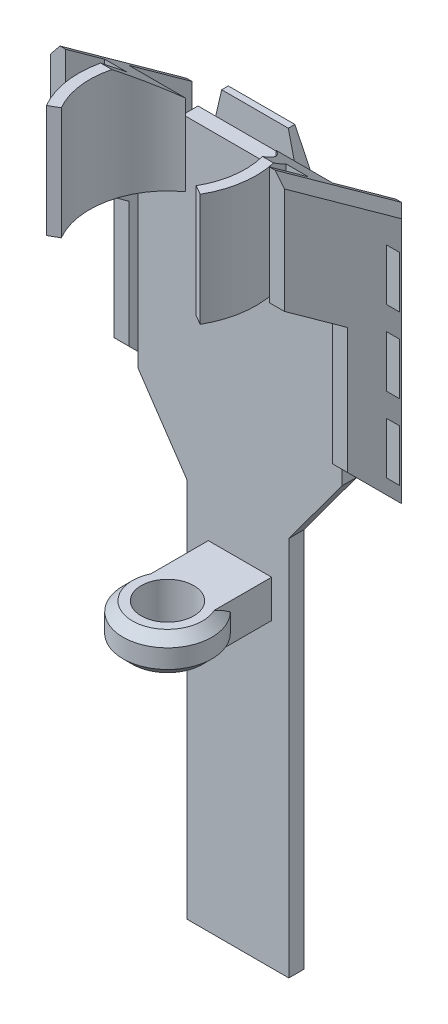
from build123d import *

# Parameters (mm, degrees)
SKETCH1_R           = 7
BOSS_EXTRUDE1_DEPTH = 10
CHAMFER1_SIZE       = 2.5
BOSS_EXTRUDE2_DEPTH = 4
CUT_EXTRUDE1_DEPTH  = 14
SKETCH4_W           = 54.262151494
SKETCH4_H           = 14.499051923
CUT_EXTRUDE2_DEPTH  = 14
BOSS_EXTRUDE3_DEPTH = 4
BOSS_EXTRUDE4_DEPTH = 4
CUT_EXTRUDE3_DEPTH  = 4
CUT_EXTRUDE4_DEPTH  = 83
LPATTERN2_COUNT     = 3
LPATTERN2_PITCH     = 20
BOSS_EXTRUDE6_DEPTH = 30
CUT_EXTRUDE7_DEPTH  = 73
BOSS_EXTRUDE7_DEPTH = 7
CUT_EXTRUDE8_DEPTH  = 33
CHAMFER2_SIZE       = 2.5


with BuildPart() as part:
    # Sketch1 → Boss-Extrude1 (new body)
    with BuildSketch(Plane(origin=(0, 0, 0), x_dir=(1, 0, 0), z_dir=(0, 1, 0))):
        with BuildLine():
            Line((-8.429952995, 8.305243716), (-8.429952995, 19.305243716))
            Line((-8.429952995, 19.305243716), (8.429952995, 19.305243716))
            Line((8.429952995, 19.305243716), (8.429952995, 8.305243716))
            ThreePointArc((8.429952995, 8.305243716), (0, -11.83389964), (-8.429952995, 8.305243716))
        make_face()
        with Locations(Location((0, 0, 0), (0, 0, 270))):
            Circle(SKETCH1_R, mode=Mode.SUBTRACT)
    extrude(amount=BOSS_EXTRUDE1_DEPTH)

    # Chamfer1
    chamfer1_edges = [part.edges().sort_by_distance(p)[0] for p in [
        (0, 10, 11.83389964),
        (0, 0, 11.83389964),
    ]]
    chamfer(chamfer1_edges, length=CHAMFER1_SIZE)

    # Sketch2 → Boss-Extrude2 (add)
    with BuildSketch(Plane(origin=(0, 0, -19.305243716), x_dir=(-1, 0, 0), z_dir=(0, 0, -1))):
        Polygon((14.130768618, -15.15472548), (27.131075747, -15.15472548), (27.131075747, 119.370191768), (-27.131075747, 119.370191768), (-27.131075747, -15.15472548), (-13.000307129, -15.15472548), (-13.000307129, -80.156261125), (14.130768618, -80.156261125), align=None)
    extrude(amount=BOSS_EXTRUDE2_DEPTH)

    # Sketch3 → Cut-Extrude1 (cut)
    with BuildSketch(Plane(origin=(0, 0, -23.305243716), x_dir=(-1, 0, 0), z_dir=(0, 0, -1))):
        Polygon((14.130768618, -15.15472548), (14.130768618, 21.210837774), (27.131075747, 40.398881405), (27.131075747, -15.15472548), align=None)
        Polygon((-13.000307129, -15.15472548), (-13.000307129, 21.210837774), (-27.131075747, 40.398881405), (-27.131075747, -15.15472548), align=None)
    extrude(amount=-CUT_EXTRUDE1_DEPTH, mode=Mode.SUBTRACT)

    # Sketch4 → Cut-Extrude2 (cut)
    with BuildSketch(Plane(origin=(0, 0, -23.305243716), x_dir=(-1, 0, 0), z_dir=(0, 0, -1))):
        with Locations((0, 112.120665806)):
            Rectangle(SKETCH4_W, SKETCH4_H)
    extrude(amount=-CUT_EXTRUDE2_DEPTH, mode=Mode.SUBTRACT)

    # Sketch5 → Boss-Extrude3 (add)
    with BuildSketch(Plane(origin=(27.131075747, 0, 0), x_dir=(0, 0, -1), z_dir=(1, 0, 0))):
        Polygon((33.720455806, 99.33039943), (0, 123.624184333), (0, 92.297988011), (16.860227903, 80.151095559), (16.860227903, 60.652136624), (16.860227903, 46.692944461), (33.720455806, 29.832716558), (33.720455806, 48.505244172), align=None)
    extrude(amount=BOSS_EXTRUDE3_DEPTH)

    # Sketch6 → Boss-Extrude4 (add)
    with BuildSketch(Plane.ZY.offset(27.131075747)):
        Polygon((-16.860227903, 46.692944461), (-33.720455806, 29.832716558), (-33.720455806, 99.33039943), (0, 123.624184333), (0, 92.297988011), (-16.860227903, 80.151095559), align=None)
    extrude(amount=BOSS_EXTRUDE4_DEPTH)

    # Sketch7 → Cut-Extrude3 (cut)
    with BuildSketch(Plane(origin=(0, 0, -23.305243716), x_dir=(-1, 0, 0), z_dir=(0, 0, -1))):
        Polygon((-16.226881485, 104.871139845), (-27.131075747, 90.65912158), (-27.131075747, 104.871139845), align=None)
        Polygon((15.175813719, 104.871139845), (27.131075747, 90.65912158), (27.131075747, 104.871139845), align=None)
    extrude(amount=-CUT_EXTRUDE3_DEPTH, mode=Mode.SUBTRACT)

    # Sketch8 → Cut-Extrude4 (cut)
    with BuildSketch(Plane.ZY.offset(31.131075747)):
        Polygon((-30.673708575, 36.815954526), (-27.237225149, 40.252437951), (-27.237225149, 53.998371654), (-30.673708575, 50.561888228), align=None)
    cut_extrude4 = extrude(amount=-CUT_EXTRUDE4_DEPTH, mode=Mode.SUBTRACT)

    # LPattern2: Cut-Extrude4 ×3
    with Locations(*[(0, i * LPATTERN2_PITCH, 0) for i in range(1, LPATTERN2_COUNT)]):
        add(cut_extrude4, mode=Mode.SUBTRACT)

    # Sketch11 → Boss-Extrude6 (add)
    with BuildSketch(Plane(origin=(0, 89.871139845, 0), x_dir=(1, 0, 0), z_dir=(0, 1, 0))):
        with BuildLine():
            Line((-27.131075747, 16.860227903), (-12.04620483, 16.860227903))
            ThreePointArc((-12.04620483, 16.860227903), (-20.246732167, 4.410008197), (-17.967060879, -10.322938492))
            Line((-17.967060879, -10.322938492), (-20.483736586, -11.76888943))
            ThreePointArc((-20.483736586, -11.76888943), (-23.610951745, -0.783058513), (-21.218499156, 10.385832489))
            Line((-21.218499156, 10.385832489), (-27.131075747, 10.385832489))
            Line((-27.131075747, 10.385832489), (-27.131075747, 16.860227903))
        make_face()
        with BuildLine():
            Line((27.131075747, 10.385832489), (27.131075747, 16.860227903))
            Line((27.131075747, 16.860227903), (12.04620483, 16.860227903))
            ThreePointArc((12.04620483, 16.860227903), (20.246732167, 4.410008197), (17.967060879, -10.322938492))
            Line((17.967060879, -10.322938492), (20.483736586, -11.76888943))
            ThreePointArc((20.483736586, -11.76888943), (23.610951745, -0.783058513), (21.218499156, 10.385832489))
            Line((21.218499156, 10.385832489), (27.131075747, 10.385832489))
        make_face()
    extrude(amount=BOSS_EXTRUDE6_DEPTH)

    # Sketch12 → Cut-Extrude7 (cut)
    with BuildSketch(Plane(origin=(31.131075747, 0, 0), x_dir=(0, 0, -1), z_dir=(1, 0, 0))):
        Polygon((5.236363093, 119.851664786), (16.860227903, 111.477291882), (16.860227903, 119.871139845), align=None)
        Polygon((16.860227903, 123.808396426), (16.860227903, 119.871139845), (5.236363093, 119.851664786), (5.236363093, 123.808396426), align=None)
    extrude(amount=-CUT_EXTRUDE7_DEPTH, mode=Mode.SUBTRACT)

    # Sketch13 → Boss-Extrude7 (add)
    with BuildSketch(Plane(origin=(0, 0, -23.305243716), x_dir=(-1, 0, 0), z_dir=(0, 0, -1))):
        Polygon((-16.133041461, 62.506168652), (-16.133041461, 34.669040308), (-8.869181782, 22.944313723), (8.869181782, 22.944313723), (16.133041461, 34.669040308), (16.133041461, 62.506168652), (16.133041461, 80.711705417), (8.869181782, 111.768119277), (-8.869181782, 111.768119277), (-16.133041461, 80.711705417), align=None)
    extrude(amount=BOSS_EXTRUDE7_DEPTH)

    # Sketch14 → Cut-Extrude8 (cut)
    with BuildSketch(Plane.ZY.offset(16.133041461)):
        Polygon((-25.058013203, 111.768119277), (-30.305243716, 80.711705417), (-30.305243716, 111.768119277), align=None)
    extrude(amount=-CUT_EXTRUDE8_DEPTH, mode=Mode.SUBTRACT)

    # Chamfer2
    chamfer2_edges = [part.edges().sort_by_distance(p)[0] for p in [
        (31.131075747, 64.581557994, -33.720455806),
        (31.131075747, 111.477291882, -16.860227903),
        (-31.131075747, 111.477291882, -16.860227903),
        (-31.131075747, 64.581557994, -33.720455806),
    ]]
    chamfer(chamfer2_edges, length=CHAMFER2_SIZE)


solid = part.part
